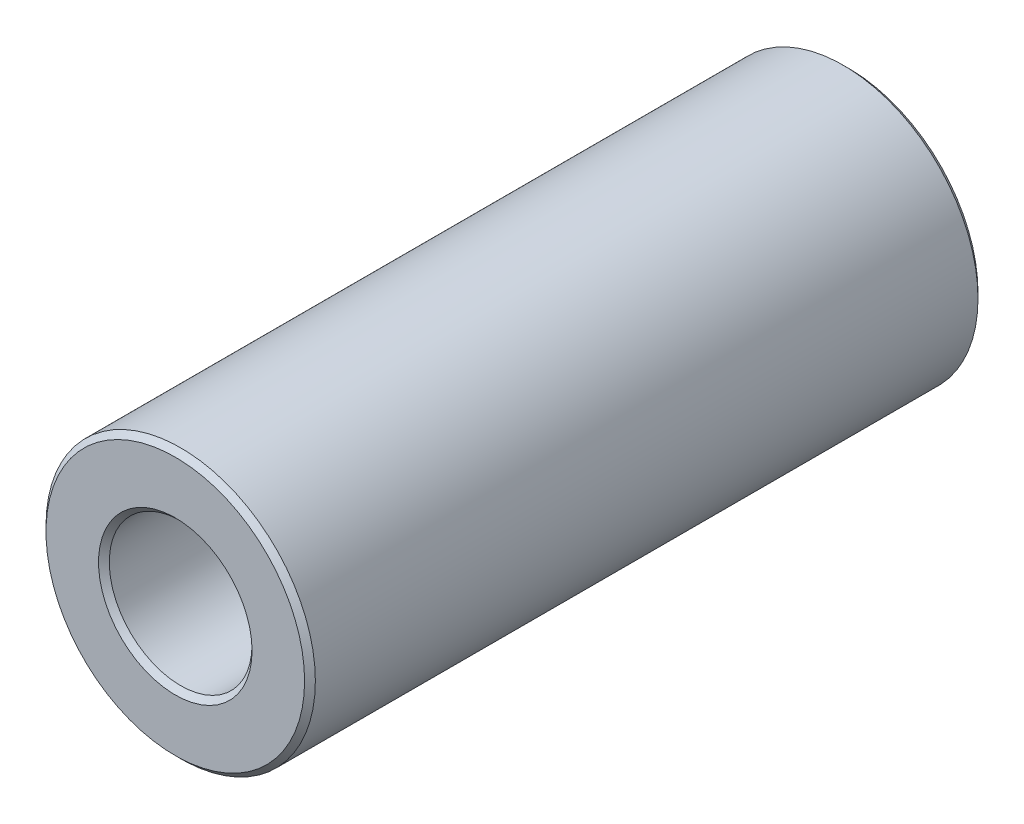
from build123d import *

# Parameters (mm, degrees)
SKETCH1_R           = 5
SKETCH1_R_2         = 2.65
BOSS_EXTRUDE2_DEPTH = 12.5
CHAMFER3_SIZE       = 0.2


with BuildPart() as part:
    # Sketch1 → Boss-Extrude2 (new, symmetric)
    with BuildSketch(Plane.XY):
        Circle(SKETCH1_R)
        Circle(SKETCH1_R_2, mode=Mode.SUBTRACT)
    extrude(amount=BOSS_EXTRUDE2_DEPTH, both=True)

    # Chamfer3
    chamfer3_edges = [part.edges().sort_by_distance(p)[0] for p in [
        (-5, 0, -12.5),
        (-5, 0, 12.5),
        (-2.65, 0, -12.5),
        (-2.65, 0, 12.5),
    ]]
    chamfer(chamfer3_edges, length=CHAMFER3_SIZE)


solid = part.part
